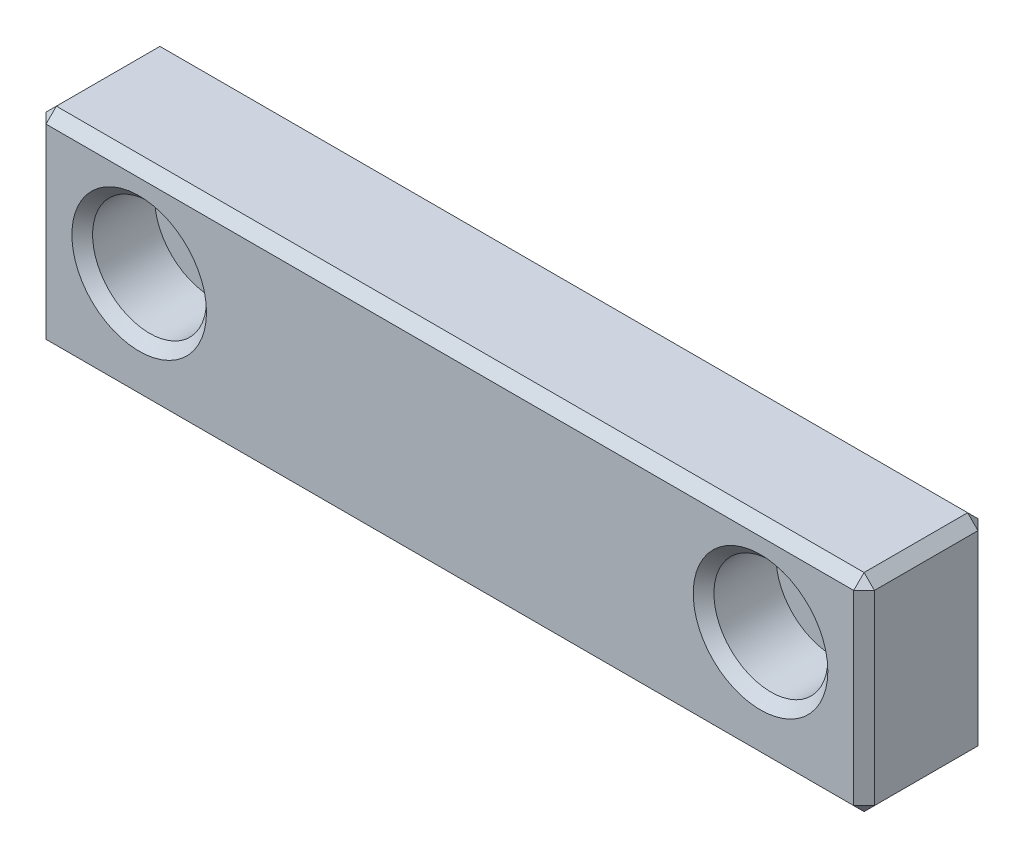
ISO-10303-21;
HEADER;
FILE_DESCRIPTION(('STEP AP214'),'2;1');
FILE_NAME('part.step','',(''),(''),'','','');
FILE_SCHEMA(('AUTOMOTIVE_DESIGN { 1 0 10303 214 1 1 1 1 }'));
ENDSEC;
DATA;
#1=APPLICATION_CONTEXT('core data for automotive mechanical design processes');
#2=APPLICATION_PROTOCOL_DEFINITION('international standard','automotive_design',2000,#1);
#3=PRODUCT_CONTEXT('',#1,'mechanical');
#4=PRODUCT('Part','Part','',(#3));
#5=PRODUCT_RELATED_PRODUCT_CATEGORY('part','',(#4));
#6=PRODUCT_DEFINITION_FORMATION('','',#4);
#7=PRODUCT_DEFINITION_CONTEXT('part definition',#1,'design');
#8=PRODUCT_DEFINITION('design','',#6,#7);
#9=PRODUCT_DEFINITION_SHAPE('','',#8);
#10=(LENGTH_UNIT() NAMED_UNIT(*) SI_UNIT(.MILLI.,.METRE.));
#11=(NAMED_UNIT(*) PLANE_ANGLE_UNIT() SI_UNIT($,.RADIAN.));
#12=(NAMED_UNIT(*) SI_UNIT($,.STERADIAN.) SOLID_ANGLE_UNIT());
#13=UNCERTAINTY_MEASURE_WITH_UNIT(LENGTH_MEASURE(1.E-05),#10,'distance_accuracy_value','');
#14=(GEOMETRIC_REPRESENTATION_CONTEXT(3) GLOBAL_UNCERTAINTY_ASSIGNED_CONTEXT((#13)) GLOBAL_UNIT_ASSIGNED_CONTEXT((#10,
#11,#12)) REPRESENTATION_CONTEXT('',''));
#15=CARTESIAN_POINT('',(0.,0.,0.));
#16=DIRECTION('',(0.,0.,1.));
#17=DIRECTION('',(1.,0.,0.));
#18=AXIS2_PLACEMENT_3D('',#15,#16,#17);
#19=CARTESIAN_POINT('',(-30.,1.,12.));
#20=DIRECTION('',(0.,0.,-1.));
#21=DIRECTION('',(-1.,0.,0.));
#22=AXIS2_PLACEMENT_3D('',#19,#20,#21);
#23=CYLINDRICAL_SURFACE('',#22,3.);
#24=CARTESIAN_POINT('',(-30.,1.,1.00000000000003));
#25=DIRECTION('',(0.,0.,1.));
#26=DIRECTION('',(1.,0.,0.));
#27=AXIS2_PLACEMENT_3D('',#24,#25,#26);
#28=CIRCLE('',#27,3.);
#29=CARTESIAN_POINT('',(-27.,1.,1.00000000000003));
#30=VERTEX_POINT('',#29);
#31=EDGE_CURVE('E156',#30,#30,#28,.F.);
#32=ORIENTED_EDGE('',*,*,#31,.T.);
#33=EDGE_LOOP('',(#32));
#34=FACE_BOUND('',#33,.T.);
#35=CARTESIAN_POINT('',(-30.,1.,5.));
#36=DIRECTION('',(0.,0.,1.));
#37=DIRECTION('',(1.,0.,0.));
#38=AXIS2_PLACEMENT_3D('',#35,#36,#37);
#39=CIRCLE('',#38,3.);
#40=CARTESIAN_POINT('',(-27.,1.,5.));
#41=VERTEX_POINT('',#40);
#42=EDGE_CURVE('E137',#41,#41,#39,.T.);
#43=ORIENTED_EDGE('',*,*,#42,.T.);
#44=EDGE_LOOP('',(#43));
#45=FACE_BOUND('',#44,.T.);
#46=ADVANCED_FACE('F16',(#34,#45),#23,.F.);
#47=CARTESIAN_POINT('',(30.,1.,12.));
#48=DIRECTION('',(0.,0.,-1.));
#49=DIRECTION('',(-1.,0.,0.));
#50=AXIS2_PLACEMENT_3D('',#47,#48,#49);
#51=CYLINDRICAL_SURFACE('',#50,3.);
#52=CARTESIAN_POINT('',(30.,1.,1.));
#53=DIRECTION('',(0.,0.,1.));
#54=DIRECTION('',(1.,0.,0.));
#55=AXIS2_PLACEMENT_3D('',#52,#53,#54);
#56=CIRCLE('',#55,3.);
#57=CARTESIAN_POINT('',(33.,1.,1.));
#58=VERTEX_POINT('',#57);
#59=EDGE_CURVE('E153',#58,#58,#56,.F.);
#60=ORIENTED_EDGE('',*,*,#59,.T.);
#61=EDGE_LOOP('',(#60));
#62=FACE_BOUND('',#61,.T.);
#63=CARTESIAN_POINT('',(30.,1.,5.));
#64=DIRECTION('',(0.,0.,1.));
#65=DIRECTION('',(1.,0.,0.));
#66=AXIS2_PLACEMENT_3D('',#63,#64,#65);
#67=CIRCLE('',#66,3.);
#68=CARTESIAN_POINT('',(33.,1.,5.));
#69=VERTEX_POINT('',#68);
#70=EDGE_CURVE('E274',#69,#69,#67,.T.);
#71=ORIENTED_EDGE('',*,*,#70,.T.);
#72=EDGE_LOOP('',(#71));
#73=FACE_BOUND('',#72,.T.);
#74=ADVANCED_FACE('F304',(#62,#73),#51,.F.);
#75=CARTESIAN_POINT('',(0.,0.,12.));
#76=DIRECTION('',(0.,0.,1.));
#77=DIRECTION('',(1.,0.,0.));
#78=AXIS2_PLACEMENT_3D('',#75,#76,#77);
#79=PLANE('',#78);
#80=DIRECTION('',(0.,1.,0.));
#81=VECTOR('',#80,1.);
#82=CARTESIAN_POINT('',(39.,10.,12.));
#83=LINE('',#82,#81);
#84=CARTESIAN_POINT('',(39.,-9.,12.));
#85=VERTEX_POINT('',#84);
#86=CARTESIAN_POINT('',(39.,9.,12.));
#87=VERTEX_POINT('',#86);
#88=EDGE_CURVE('E33',#85,#87,#83,.T.);
#89=ORIENTED_EDGE('',*,*,#88,.T.);
#90=DIRECTION('',(-1.,0.,0.));
#91=VECTOR('',#90,1.);
#92=CARTESIAN_POINT('',(-40.,9.,12.));
#93=LINE('',#92,#91);
#94=CARTESIAN_POINT('',(-39.,9.,12.));
#95=VERTEX_POINT('',#94);
#96=EDGE_CURVE('E203',#87,#95,#93,.T.);
#97=ORIENTED_EDGE('',*,*,#96,.T.);
#98=DIRECTION('',(0.,-1.,0.));
#99=VECTOR('',#98,1.);
#100=CARTESIAN_POINT('',(-39.,-10.,12.));
#101=LINE('',#100,#99);
#102=CARTESIAN_POINT('',(-39.,-9.,12.));
#103=VERTEX_POINT('',#102);
#104=EDGE_CURVE('E199',#95,#103,#101,.T.);
#105=ORIENTED_EDGE('',*,*,#104,.T.);
#106=DIRECTION('',(1.,0.,0.));
#107=VECTOR('',#106,1.);
#108=CARTESIAN_POINT('',(40.,-9.,12.));
#109=LINE('',#108,#107);
#110=EDGE_CURVE('E38',#103,#85,#109,.T.);
#111=ORIENTED_EDGE('',*,*,#110,.T.);
#112=EDGE_LOOP('',(#89,#97,#105,#111));
#113=FACE_BOUND('',#112,.T.);
#114=CARTESIAN_POINT('',(30.,1.,12.));
#115=DIRECTION('',(0.,0.,1.));
#116=DIRECTION('',(1.,0.,0.));
#117=AXIS2_PLACEMENT_3D('',#114,#115,#116);
#118=CIRCLE('',#117,6.5);
#119=CARTESIAN_POINT('',(36.5,1.,12.));
#120=VERTEX_POINT('',#119);
#121=EDGE_CURVE('E196',#120,#120,#118,.F.);
#122=ORIENTED_EDGE('',*,*,#121,.T.);
#123=EDGE_LOOP('',(#122));
#124=FACE_BOUND('',#123,.T.);
#125=CARTESIAN_POINT('',(-30.,1.,12.));
#126=DIRECTION('',(0.,0.,1.));
#127=DIRECTION('',(1.,0.,0.));
#128=AXIS2_PLACEMENT_3D('',#125,#126,#127);
#129=CIRCLE('',#128,6.5);
#130=CARTESIAN_POINT('',(-23.5,1.,12.));
#131=VERTEX_POINT('',#130);
#132=EDGE_CURVE('E193',#131,#131,#129,.F.);
#133=ORIENTED_EDGE('',*,*,#132,.T.);
#134=EDGE_LOOP('',(#133));
#135=FACE_BOUND('',#134,.T.);
#136=ADVANCED_FACE('F311',(#113,#124,#135),#79,.T.);
#137=CARTESIAN_POINT('',(0.,0.,0.));
#138=DIRECTION('',(0.,0.,1.));
#139=DIRECTION('',(1.,0.,0.));
#140=AXIS2_PLACEMENT_3D('',#137,#138,#139);
#141=PLANE('',#140);
#142=CARTESIAN_POINT('',(30.,1.,0.));
#143=DIRECTION('',(0.,0.,1.));
#144=DIRECTION('',(1.,0.,0.));
#145=AXIS2_PLACEMENT_3D('',#142,#143,#144);
#146=CIRCLE('',#145,4.);
#147=CARTESIAN_POINT('',(34.,1.,0.));
#148=VERTEX_POINT('',#147);
#149=EDGE_CURVE('E150',#148,#148,#146,.T.);
#150=ORIENTED_EDGE('',*,*,#149,.T.);
#151=EDGE_LOOP('',(#150));
#152=FACE_BOUND('',#151,.T.);
#153=CARTESIAN_POINT('',(-30.,1.,0.));
#154=DIRECTION('',(0.,0.,1.));
#155=DIRECTION('',(1.,0.,0.));
#156=AXIS2_PLACEMENT_3D('',#153,#154,#155);
#157=CIRCLE('',#156,4.);
#158=CARTESIAN_POINT('',(-26.,1.,0.));
#159=VERTEX_POINT('',#158);
#160=EDGE_CURVE('E144',#159,#159,#157,.T.);
#161=ORIENTED_EDGE('',*,*,#160,.T.);
#162=EDGE_LOOP('',(#161));
#163=FACE_BOUND('',#162,.T.);
#164=DIRECTION('',(0.,1.,0.));
#165=VECTOR('',#164,1.);
#166=CARTESIAN_POINT('',(-39.,0.,0.));
#167=LINE('',#166,#165);
#168=CARTESIAN_POINT('',(-39.,-9.,0.));
#169=VERTEX_POINT('',#168);
#170=CARTESIAN_POINT('',(-39.,9.,0.));
#171=VERTEX_POINT('',#170);
#172=EDGE_CURVE('E136',#169,#171,#167,.T.);
#173=ORIENTED_EDGE('',*,*,#172,.T.);
#174=DIRECTION('',(1.,0.,0.));
#175=VECTOR('',#174,1.);
#176=CARTESIAN_POINT('',(0.,9.,0.));
#177=LINE('',#176,#175);
#178=CARTESIAN_POINT('',(39.,9.,0.));
#179=VERTEX_POINT('',#178);
#180=EDGE_CURVE('E141',#171,#179,#177,.T.);
#181=ORIENTED_EDGE('',*,*,#180,.T.);
#182=DIRECTION('',(0.,-1.,0.));
#183=VECTOR('',#182,1.);
#184=CARTESIAN_POINT('',(39.,0.,0.));
#185=LINE('',#184,#183);
#186=CARTESIAN_POINT('',(39.,-9.,0.));
#187=VERTEX_POINT('',#186);
#188=EDGE_CURVE('E111',#179,#187,#185,.T.);
#189=ORIENTED_EDGE('',*,*,#188,.T.);
#190=DIRECTION('',(-1.,0.,0.));
#191=VECTOR('',#190,1.);
#192=CARTESIAN_POINT('',(0.,-9.,0.));
#193=LINE('',#192,#191);
#194=EDGE_CURVE('E130',#187,#169,#193,.T.);
#195=ORIENTED_EDGE('',*,*,#194,.T.);
#196=EDGE_LOOP('',(#173,#181,#189,#195));
#197=FACE_BOUND('',#196,.T.);
#198=ADVANCED_FACE('F139',(#152,#163,#197),#141,.F.);
#199=CARTESIAN_POINT('',(-40.,-10.,12.));
#200=DIRECTION('',(1.,0.,0.));
#201=DIRECTION('',(0.,0.,-1.));
#202=AXIS2_PLACEMENT_3D('',#199,#200,#201);
#203=PLANE('',#202);
#204=DIRECTION('',(0.,0.,-1.));
#205=VECTOR('',#204,1.);
#206=CARTESIAN_POINT('',(-40.,9.,12.));
#207=LINE('',#206,#205);
#208=CARTESIAN_POINT('',(-40.,9.,11.));
#209=VERTEX_POINT('',#208);
#210=CARTESIAN_POINT('',(-40.,9.,1.00000000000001));
#211=VERTEX_POINT('',#210);
#212=EDGE_CURVE('E170',#209,#211,#207,.T.);
#213=ORIENTED_EDGE('',*,*,#212,.T.);
#214=DIRECTION('',(0.,-1.,0.));
#215=VECTOR('',#214,1.);
#216=CARTESIAN_POINT('',(-40.,-10.,1.00000000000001));
#217=LINE('',#216,#215);
#218=CARTESIAN_POINT('',(-40.,-9.,1.00000000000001));
#219=VERTEX_POINT('',#218);
#220=EDGE_CURVE('E172',#211,#219,#217,.T.);
#221=ORIENTED_EDGE('',*,*,#220,.T.);
#222=DIRECTION('',(0.,0.,1.));
#223=VECTOR('',#222,1.);
#224=CARTESIAN_POINT('',(-40.,-9.,12.));
#225=LINE('',#224,#223);
#226=CARTESIAN_POINT('',(-40.,-9.,11.));
#227=VERTEX_POINT('',#226);
#228=EDGE_CURVE('E168',#219,#227,#225,.T.);
#229=ORIENTED_EDGE('',*,*,#228,.T.);
#230=DIRECTION('',(0.,1.,0.));
#231=VECTOR('',#230,1.);
#232=CARTESIAN_POINT('',(-40.,10.,11.));
#233=LINE('',#232,#231);
#234=EDGE_CURVE('E166',#227,#209,#233,.T.);
#235=ORIENTED_EDGE('',*,*,#234,.T.);
#236=EDGE_LOOP('',(#213,#221,#229,#235));
#237=FACE_BOUND('',#236,.T.);
#238=ADVANCED_FACE('F320',(#237),#203,.F.);
#239=CARTESIAN_POINT('',(40.,-10.,12.));
#240=DIRECTION('',(0.,1.,0.));
#241=DIRECTION('',(-1.,0.,0.));
#242=AXIS2_PLACEMENT_3D('',#239,#240,#241);
#243=PLANE('',#242);
#244=DIRECTION('',(-1.,0.,0.));
#245=VECTOR('',#244,1.);
#246=CARTESIAN_POINT('',(-40.,-10.,11.));
#247=LINE('',#246,#245);
#248=CARTESIAN_POINT('',(39.,-10.,11.));
#249=VERTEX_POINT('',#248);
#250=CARTESIAN_POINT('',(-39.,-10.,11.));
#251=VERTEX_POINT('',#250);
#252=EDGE_CURVE('E184',#249,#251,#247,.T.);
#253=ORIENTED_EDGE('',*,*,#252,.T.);
#254=DIRECTION('',(0.,0.,-1.));
#255=VECTOR('',#254,1.);
#256=CARTESIAN_POINT('',(-39.,-10.,12.));
#257=LINE('',#256,#255);
#258=CARTESIAN_POINT('',(-39.,-10.,1.));
#259=VERTEX_POINT('',#258);
#260=EDGE_CURVE('E190',#251,#259,#257,.T.);
#261=ORIENTED_EDGE('',*,*,#260,.T.);
#262=DIRECTION('',(1.,0.,0.));
#263=VECTOR('',#262,1.);
#264=CARTESIAN_POINT('',(40.,-10.,1.));
#265=LINE('',#264,#263);
#266=CARTESIAN_POINT('',(39.,-10.,1.));
#267=VERTEX_POINT('',#266);
#268=EDGE_CURVE('E188',#259,#267,#265,.T.);
#269=ORIENTED_EDGE('',*,*,#268,.T.);
#270=DIRECTION('',(0.,0.,1.));
#271=VECTOR('',#270,1.);
#272=CARTESIAN_POINT('',(39.,-10.,12.));
#273=LINE('',#272,#271);
#274=EDGE_CURVE('E186',#267,#249,#273,.T.);
#275=ORIENTED_EDGE('',*,*,#274,.T.);
#276=EDGE_LOOP('',(#253,#261,#269,#275));
#277=FACE_BOUND('',#276,.T.);
#278=ADVANCED_FACE('F329',(#277),#243,.F.);
#279=CARTESIAN_POINT('',(40.,-10.,12.));
#280=DIRECTION('',(-1.,0.,0.));
#281=DIRECTION('',(0.,0.,1.));
#282=AXIS2_PLACEMENT_3D('',#279,#280,#281);
#283=PLANE('',#282);
#284=DIRECTION('',(0.,0.,-1.));
#285=VECTOR('',#284,1.);
#286=CARTESIAN_POINT('',(40.,-9.,12.));
#287=LINE('',#286,#285);
#288=CARTESIAN_POINT('',(40.,-9.,11.));
#289=VERTEX_POINT('',#288);
#290=CARTESIAN_POINT('',(40.,-9.,1.));
#291=VERTEX_POINT('',#290);
#292=EDGE_CURVE('E161',#289,#291,#287,.T.);
#293=ORIENTED_EDGE('',*,*,#292,.T.);
#294=DIRECTION('',(0.,1.,0.));
#295=VECTOR('',#294,1.);
#296=CARTESIAN_POINT('',(40.,-10.,1.));
#297=LINE('',#296,#295);
#298=CARTESIAN_POINT('',(40.,9.,1.));
#299=VERTEX_POINT('',#298);
#300=EDGE_CURVE('E114',#291,#299,#297,.T.);
#301=ORIENTED_EDGE('',*,*,#300,.T.);
#302=DIRECTION('',(0.,0.,1.));
#303=VECTOR('',#302,1.);
#304=CARTESIAN_POINT('',(40.,9.,12.));
#305=LINE('',#304,#303);
#306=CARTESIAN_POINT('',(40.,9.,11.));
#307=VERTEX_POINT('',#306);
#308=EDGE_CURVE('E163',#299,#307,#305,.T.);
#309=ORIENTED_EDGE('',*,*,#308,.T.);
#310=DIRECTION('',(0.,-1.,0.));
#311=VECTOR('',#310,1.);
#312=CARTESIAN_POINT('',(40.,-10.,11.));
#313=LINE('',#312,#311);
#314=EDGE_CURVE('E159',#307,#289,#313,.T.);
#315=ORIENTED_EDGE('',*,*,#314,.T.);
#316=EDGE_LOOP('',(#293,#301,#309,#315));
#317=FACE_BOUND('',#316,.T.);
#318=ADVANCED_FACE('F325',(#317),#283,.F.);
#319=CARTESIAN_POINT('',(40.,10.,12.));
#320=DIRECTION('',(0.,-1.,0.));
#321=DIRECTION('',(1.,0.,0.));
#322=AXIS2_PLACEMENT_3D('',#319,#320,#321);
#323=PLANE('',#322);
#324=DIRECTION('',(1.,0.,0.));
#325=VECTOR('',#324,1.);
#326=CARTESIAN_POINT('',(40.,10.,11.));
#327=LINE('',#326,#325);
#328=CARTESIAN_POINT('',(-39.,10.,11.));
#329=VERTEX_POINT('',#328);
#330=CARTESIAN_POINT('',(39.,10.,11.));
#331=VERTEX_POINT('',#330);
#332=EDGE_CURVE('E175',#329,#331,#327,.T.);
#333=ORIENTED_EDGE('',*,*,#332,.T.);
#334=DIRECTION('',(0.,0.,-1.));
#335=VECTOR('',#334,1.);
#336=CARTESIAN_POINT('',(39.,10.,12.));
#337=LINE('',#336,#335);
#338=CARTESIAN_POINT('',(39.,10.,1.));
#339=VERTEX_POINT('',#338);
#340=EDGE_CURVE('E181',#331,#339,#337,.T.);
#341=ORIENTED_EDGE('',*,*,#340,.T.);
#342=DIRECTION('',(-1.,0.,0.));
#343=VECTOR('',#342,1.);
#344=CARTESIAN_POINT('',(40.,10.,1.));
#345=LINE('',#344,#343);
#346=CARTESIAN_POINT('',(-39.,10.,1.));
#347=VERTEX_POINT('',#346);
#348=EDGE_CURVE('E179',#339,#347,#345,.T.);
#349=ORIENTED_EDGE('',*,*,#348,.T.);
#350=DIRECTION('',(0.,0.,1.));
#351=VECTOR('',#350,1.);
#352=CARTESIAN_POINT('',(-39.,10.,12.));
#353=LINE('',#352,#351);
#354=EDGE_CURVE('E177',#347,#329,#353,.T.);
#355=ORIENTED_EDGE('',*,*,#354,.T.);
#356=EDGE_LOOP('',(#333,#341,#349,#355));
#357=FACE_BOUND('',#356,.T.);
#358=ADVANCED_FACE('F322',(#357),#323,.F.);
#359=CARTESIAN_POINT('',(30.,1.,5.));
#360=DIRECTION('',(0.,0.,1.));
#361=DIRECTION('',(1.,0.,0.));
#362=AXIS2_PLACEMENT_3D('',#359,#360,#361);
#363=CYLINDRICAL_SURFACE('',#362,5.5);
#364=CARTESIAN_POINT('',(30.,1.,11.));
#365=DIRECTION('',(0.,0.,1.));
#366=DIRECTION('',(1.,0.,0.));
#367=AXIS2_PLACEMENT_3D('',#364,#365,#366);
#368=CIRCLE('',#367,5.5);
#369=CARTESIAN_POINT('',(35.5,1.,11.));
#370=VERTEX_POINT('',#369);
#371=EDGE_CURVE('E25',#370,#370,#368,.T.);
#372=ORIENTED_EDGE('',*,*,#371,.T.);
#373=EDGE_LOOP('',(#372));
#374=FACE_BOUND('',#373,.T.);
#375=CARTESIAN_POINT('',(30.,1.,5.));
#376=DIRECTION('',(0.,0.,1.));
#377=DIRECTION('',(1.,0.,0.));
#378=AXIS2_PLACEMENT_3D('',#375,#376,#377);
#379=CIRCLE('',#378,5.5);
#380=CARTESIAN_POINT('',(35.5,1.,5.));
#381=VERTEX_POINT('',#380);
#382=EDGE_CURVE('E263',#381,#381,#379,.T.);
#383=ORIENTED_EDGE('',*,*,#382,.F.);
#384=EDGE_LOOP('',(#383));
#385=FACE_BOUND('',#384,.T.);
#386=ADVANCED_FACE('F300',(#374,#385),#363,.F.);
#387=CARTESIAN_POINT('',(30.,1.,5.));
#388=DIRECTION('',(0.,0.,1.));
#389=DIRECTION('',(1.,0.,0.));
#390=AXIS2_PLACEMENT_3D('',#387,#388,#389);
#391=PLANE('',#390);
#392=ORIENTED_EDGE('',*,*,#70,.F.);
#393=EDGE_LOOP('',(#392));
#394=FACE_BOUND('',#393,.T.);
#395=ORIENTED_EDGE('',*,*,#382,.T.);
#396=EDGE_LOOP('',(#395));
#397=FACE_BOUND('',#396,.T.);
#398=ADVANCED_FACE('F292',(#394,#397),#391,.T.);
#399=CARTESIAN_POINT('',(-30.,1.,5.));
#400=DIRECTION('',(0.,0.,1.));
#401=DIRECTION('',(1.,0.,0.));
#402=AXIS2_PLACEMENT_3D('',#399,#400,#401);
#403=CYLINDRICAL_SURFACE('',#402,5.5);
#404=CARTESIAN_POINT('',(-30.,1.,11.));
#405=DIRECTION('',(0.,0.,1.));
#406=DIRECTION('',(1.,0.,0.));
#407=AXIS2_PLACEMENT_3D('',#404,#405,#406);
#408=CIRCLE('',#407,5.5);
#409=CARTESIAN_POINT('',(-24.5,1.,11.));
#410=VERTEX_POINT('',#409);
#411=EDGE_CURVE('E10',#410,#410,#408,.T.);
#412=ORIENTED_EDGE('',*,*,#411,.T.);
#413=EDGE_LOOP('',(#412));
#414=FACE_BOUND('',#413,.T.);
#415=CARTESIAN_POINT('',(-30.,1.,5.));
#416=DIRECTION('',(0.,0.,1.));
#417=DIRECTION('',(1.,0.,0.));
#418=AXIS2_PLACEMENT_3D('',#415,#416,#417);
#419=CIRCLE('',#418,5.5);
#420=CARTESIAN_POINT('',(-24.5,1.,5.));
#421=VERTEX_POINT('',#420);
#422=EDGE_CURVE('E269',#421,#421,#419,.T.);
#423=ORIENTED_EDGE('',*,*,#422,.F.);
#424=EDGE_LOOP('',(#423));
#425=FACE_BOUND('',#424,.T.);
#426=ADVANCED_FACE('F287',(#414,#425),#403,.F.);
#427=CARTESIAN_POINT('',(-30.,1.,5.));
#428=DIRECTION('',(0.,0.,1.));
#429=DIRECTION('',(1.,0.,0.));
#430=AXIS2_PLACEMENT_3D('',#427,#428,#429);
#431=PLANE('',#430);
#432=ORIENTED_EDGE('',*,*,#42,.F.);
#433=EDGE_LOOP('',(#432));
#434=FACE_BOUND('',#433,.T.);
#435=ORIENTED_EDGE('',*,*,#422,.T.);
#436=EDGE_LOOP('',(#435));
#437=FACE_BOUND('',#436,.T.);
#438=ADVANCED_FACE('F283',(#434,#437),#431,.T.);
#439=CARTESIAN_POINT('',(30.,1.,0.));
#440=DIRECTION('',(0.,0.,-1.));
#441=DIRECTION('',(-1.,0.,0.));
#442=AXIS2_PLACEMENT_3D('',#439,#440,#441);
#443=CONICAL_SURFACE('',#442,4.,0.785398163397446);
#444=ORIENTED_EDGE('',*,*,#59,.F.);
#445=EDGE_LOOP('',(#444));
#446=FACE_BOUND('',#445,.T.);
#447=ORIENTED_EDGE('',*,*,#149,.F.);
#448=EDGE_LOOP('',(#447));
#449=FACE_BOUND('',#448,.T.);
#450=ADVANCED_FACE('F286',(#446,#449),#443,.F.);
#451=CARTESIAN_POINT('',(-30.,1.,0.));
#452=DIRECTION('',(0.,0.,-1.));
#453=DIRECTION('',(-1.,0.,0.));
#454=AXIS2_PLACEMENT_3D('',#451,#452,#453);
#455=CONICAL_SURFACE('',#454,4.,0.785398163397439);
#456=ORIENTED_EDGE('',*,*,#31,.F.);
#457=EDGE_LOOP('',(#456));
#458=FACE_BOUND('',#457,.T.);
#459=ORIENTED_EDGE('',*,*,#160,.F.);
#460=EDGE_LOOP('',(#459));
#461=FACE_BOUND('',#460,.T.);
#462=ADVANCED_FACE('F339',(#458,#461),#455,.F.);
#463=CARTESIAN_POINT('',(-39.,0.,12.));
#464=DIRECTION('',(-0.707106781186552,0.,0.707106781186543));
#465=DIRECTION('',(0.,1.,0.));
#466=AXIS2_PLACEMENT_3D('',#463,#464,#465);
#467=PLANE('',#466);
#468=DIRECTION('',(-0.707106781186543,0.,-0.707106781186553));
#469=VECTOR('',#468,1.);
#470=CARTESIAN_POINT('',(-40.,-9.,11.));
#471=LINE('',#470,#469);
#472=EDGE_CURVE('E20',#103,#227,#471,.T.);
#473=ORIENTED_EDGE('',*,*,#472,.F.);
#474=ORIENTED_EDGE('',*,*,#104,.F.);
#475=DIRECTION('',(0.707106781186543,0.,0.707106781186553));
#476=VECTOR('',#475,1.);
#477=CARTESIAN_POINT('',(-39.5,9.,11.5));
#478=LINE('',#477,#476);
#479=EDGE_CURVE('E255',#209,#95,#478,.T.);
#480=ORIENTED_EDGE('',*,*,#479,.F.);
#481=ORIENTED_EDGE('',*,*,#234,.F.);
#482=EDGE_LOOP('',(#473,#474,#480,#481));
#483=FACE_BOUND('',#482,.T.);
#484=ADVANCED_FACE('F343',(#483),#467,.T.);
#485=CARTESIAN_POINT('',(-40.,-9.,11.));
#486=DIRECTION('',(-0.577350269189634,-0.577350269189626,0.577350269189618));
#487=DIRECTION('',(0.707106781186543,-0.707106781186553,0.));
#488=AXIS2_PLACEMENT_3D('',#485,#486,#487);
#489=PLANE('',#488);
#490=DIRECTION('',(0.,0.707106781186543,0.707106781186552));
#491=VECTOR('',#490,1.);
#492=CARTESIAN_POINT('',(-39.,-9.5,11.5));
#493=LINE('',#492,#491);
#494=EDGE_CURVE('E250',#103,#251,#493,.F.);
#495=ORIENTED_EDGE('',*,*,#494,.F.);
#496=ORIENTED_EDGE('',*,*,#472,.T.);
#497=DIRECTION('',(-0.707106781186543,0.707106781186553,0.));
#498=VECTOR('',#497,1.);
#499=CARTESIAN_POINT('',(-40.,-9.,11.));
#500=LINE('',#499,#498);
#501=EDGE_CURVE('E253',#251,#227,#500,.T.);
#502=ORIENTED_EDGE('',*,*,#501,.F.);
#503=EDGE_LOOP('',(#495,#496,#502));
#504=FACE_BOUND('',#503,.T.);
#505=ADVANCED_FACE('F411',(#504),#489,.T.);
#506=CARTESIAN_POINT('',(-39.,10.,11.));
#507=DIRECTION('',(-0.577350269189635,0.577350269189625,0.577350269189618));
#508=DIRECTION('',(-0.707106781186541,-0.707106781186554,0.));
#509=AXIS2_PLACEMENT_3D('',#506,#507,#508);
#510=PLANE('',#509);
#511=DIRECTION('',(0.707106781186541,0.707106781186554,0.));
#512=VECTOR('',#511,1.);
#513=CARTESIAN_POINT('',(-39.,10.,11.));
#514=LINE('',#513,#512);
#515=EDGE_CURVE('E245',#209,#329,#514,.T.);
#516=ORIENTED_EDGE('',*,*,#515,.F.);
#517=ORIENTED_EDGE('',*,*,#479,.T.);
#518=DIRECTION('',(0.,0.707106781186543,-0.707106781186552));
#519=VECTOR('',#518,1.);
#520=CARTESIAN_POINT('',(-39.,10.,11.));
#521=LINE('',#520,#519);
#522=EDGE_CURVE('E248',#329,#95,#521,.F.);
#523=ORIENTED_EDGE('',*,*,#522,.F.);
#524=EDGE_LOOP('',(#516,#517,#523));
#525=FACE_BOUND('',#524,.T.);
#526=ADVANCED_FACE('F407',(#525),#510,.T.);
#527=CARTESIAN_POINT('',(-39.,-10.,12.));
#528=DIRECTION('',(0.707106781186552,0.707106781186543,0.));
#529=DIRECTION('',(0.,0.,-1.));
#530=AXIS2_PLACEMENT_3D('',#527,#528,#529);
#531=PLANE('',#530);
#532=ORIENTED_EDGE('',*,*,#501,.T.);
#533=ORIENTED_EDGE('',*,*,#228,.F.);
#534=DIRECTION('',(0.707106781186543,-0.707106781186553,0.));
#535=VECTOR('',#534,1.);
#536=CARTESIAN_POINT('',(-40.,-9.,1.00000000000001));
#537=LINE('',#536,#535);
#538=EDGE_CURVE('E240',#259,#219,#537,.F.);
#539=ORIENTED_EDGE('',*,*,#538,.F.);
#540=ORIENTED_EDGE('',*,*,#260,.F.);
#541=EDGE_LOOP('',(#532,#533,#539,#540));
#542=FACE_BOUND('',#541,.T.);
#543=ADVANCED_FACE('F403',(#542),#531,.F.);
#544=CARTESIAN_POINT('',(0.,-9.,12.));
#545=DIRECTION('',(0.,-0.707106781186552,0.707106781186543));
#546=DIRECTION('',(-1.,0.,0.));
#547=AXIS2_PLACEMENT_3D('',#544,#545,#546);
#548=PLANE('',#547);
#549=ORIENTED_EDGE('',*,*,#494,.T.);
#550=ORIENTED_EDGE('',*,*,#252,.F.);
#551=DIRECTION('',(0.,-0.707106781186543,-0.707106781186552));
#552=VECTOR('',#551,1.);
#553=CARTESIAN_POINT('',(39.,-10.,11.));
#554=LINE('',#553,#552);
#555=EDGE_CURVE('E237',#85,#249,#554,.T.);
#556=ORIENTED_EDGE('',*,*,#555,.F.);
#557=ORIENTED_EDGE('',*,*,#110,.F.);
#558=EDGE_LOOP('',(#549,#550,#556,#557));
#559=FACE_BOUND('',#558,.T.);
#560=ADVANCED_FACE('F399',(#559),#548,.T.);
#561=CARTESIAN_POINT('',(39.,0.,12.));
#562=DIRECTION('',(0.707106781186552,0.,0.707106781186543));
#563=DIRECTION('',(0.,-1.,0.));
#564=AXIS2_PLACEMENT_3D('',#561,#562,#563);
#565=PLANE('',#564);
#566=DIRECTION('',(0.707106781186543,0.,-0.707106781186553));
#567=VECTOR('',#566,1.);
#568=CARTESIAN_POINT('',(40.,9.,11.));
#569=LINE('',#568,#567);
#570=EDGE_CURVE('E231',#87,#307,#569,.T.);
#571=ORIENTED_EDGE('',*,*,#570,.F.);
#572=ORIENTED_EDGE('',*,*,#88,.F.);
#573=DIRECTION('',(-0.707106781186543,0.,0.707106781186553));
#574=VECTOR('',#573,1.);
#575=CARTESIAN_POINT('',(39.5,-9.,11.5));
#576=LINE('',#575,#574);
#577=EDGE_CURVE('E234',#289,#85,#576,.T.);
#578=ORIENTED_EDGE('',*,*,#577,.F.);
#579=ORIENTED_EDGE('',*,*,#314,.F.);
#580=EDGE_LOOP('',(#571,#572,#578,#579));
#581=FACE_BOUND('',#580,.T.);
#582=ADVANCED_FACE('F395',(#581),#565,.T.);
#583=CARTESIAN_POINT('',(0.,9.,12.));
#584=DIRECTION('',(0.,0.707106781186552,0.707106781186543));
#585=DIRECTION('',(1.,0.,0.));
#586=AXIS2_PLACEMENT_3D('',#583,#584,#585);
#587=PLANE('',#586);
#588=ORIENTED_EDGE('',*,*,#522,.T.);
#589=ORIENTED_EDGE('',*,*,#96,.F.);
#590=DIRECTION('',(0.,-0.707106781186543,0.707106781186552));
#591=VECTOR('',#590,1.);
#592=CARTESIAN_POINT('',(39.,9.5,11.5));
#593=LINE('',#592,#591);
#594=EDGE_CURVE('E228',#331,#87,#593,.T.);
#595=ORIENTED_EDGE('',*,*,#594,.F.);
#596=ORIENTED_EDGE('',*,*,#332,.F.);
#597=EDGE_LOOP('',(#588,#589,#595,#596));
#598=FACE_BOUND('',#597,.T.);
#599=ADVANCED_FACE('F391',(#598),#587,.T.);
#600=CARTESIAN_POINT('',(-40.,9.,12.));
#601=DIRECTION('',(0.707106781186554,-0.707106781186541,0.));
#602=DIRECTION('',(0.,0.,-1.));
#603=AXIS2_PLACEMENT_3D('',#600,#601,#602);
#604=PLANE('',#603);
#605=ORIENTED_EDGE('',*,*,#515,.T.);
#606=ORIENTED_EDGE('',*,*,#354,.F.);
#607=DIRECTION('',(-0.707106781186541,-0.707106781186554,0.));
#608=VECTOR('',#607,1.);
#609=CARTESIAN_POINT('',(-39.5,9.5,1.));
#610=LINE('',#609,#608);
#611=EDGE_CURVE('E225',#211,#347,#610,.F.);
#612=ORIENTED_EDGE('',*,*,#611,.F.);
#613=ORIENTED_EDGE('',*,*,#212,.F.);
#614=EDGE_LOOP('',(#605,#606,#612,#613));
#615=FACE_BOUND('',#614,.T.);
#616=ADVANCED_FACE('F387',(#615),#604,.F.);
#617=CARTESIAN_POINT('',(-40.,-10.,1.00000000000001));
#618=DIRECTION('',(0.707106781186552,0.,0.707106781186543));
#619=DIRECTION('',(0.,-1.,0.));
#620=AXIS2_PLACEMENT_3D('',#617,#618,#619);
#621=PLANE('',#620);
#622=DIRECTION('',(-0.707106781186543,0.,0.707106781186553));
#623=VECTOR('',#622,1.);
#624=CARTESIAN_POINT('',(-40.,-9.,1.00000000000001));
#625=LINE('',#624,#623);
#626=EDGE_CURVE('E242',#219,#169,#625,.F.);
#627=ORIENTED_EDGE('',*,*,#626,.F.);
#628=ORIENTED_EDGE('',*,*,#220,.F.);
#629=DIRECTION('',(0.707106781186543,0.,-0.707106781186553));
#630=VECTOR('',#629,1.);
#631=CARTESIAN_POINT('',(-39.,9.,0.));
#632=LINE('',#631,#630);
#633=EDGE_CURVE('E222',#171,#211,#632,.F.);
#634=ORIENTED_EDGE('',*,*,#633,.F.);
#635=ORIENTED_EDGE('',*,*,#172,.F.);
#636=EDGE_LOOP('',(#627,#628,#634,#635));
#637=FACE_BOUND('',#636,.T.);
#638=ADVANCED_FACE('F383',(#637),#621,.F.);
#639=CARTESIAN_POINT('',(-40.,-9.,1.00000000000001));
#640=DIRECTION('',(-0.577350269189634,-0.577350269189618,-0.577350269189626));
#641=DIRECTION('',(-0.707106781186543,0.,0.707106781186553));
#642=AXIS2_PLACEMENT_3D('',#639,#640,#641);
#643=PLANE('',#642);
#644=ORIENTED_EDGE('',*,*,#538,.T.);
#645=ORIENTED_EDGE('',*,*,#626,.T.);
#646=DIRECTION('',(0.,0.707106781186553,-0.707106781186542));
#647=VECTOR('',#646,1.);
#648=CARTESIAN_POINT('',(-39.,-9.5,0.5));
#649=LINE('',#648,#647);
#650=EDGE_CURVE('E133',#259,#169,#649,.T.);
#651=ORIENTED_EDGE('',*,*,#650,.F.);
#652=EDGE_LOOP('',(#644,#645,#651));
#653=FACE_BOUND('',#652,.T.);
#654=ADVANCED_FACE('F379',(#653),#643,.T.);
#655=CARTESIAN_POINT('',(39.,-10.,11.));
#656=DIRECTION('',(0.577350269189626,-0.577350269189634,0.577350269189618));
#657=DIRECTION('',(0.707106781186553,0.707106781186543,0.));
#658=AXIS2_PLACEMENT_3D('',#655,#656,#657);
#659=PLANE('',#658);
#660=ORIENTED_EDGE('',*,*,#577,.T.);
#661=ORIENTED_EDGE('',*,*,#555,.T.);
#662=DIRECTION('',(-0.707106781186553,-0.707106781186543,0.));
#663=VECTOR('',#662,1.);
#664=CARTESIAN_POINT('',(39.,-10.,11.));
#665=LINE('',#664,#663);
#666=EDGE_CURVE('E218',#289,#249,#665,.T.);
#667=ORIENTED_EDGE('',*,*,#666,.F.);
#668=EDGE_LOOP('',(#660,#661,#667));
#669=FACE_BOUND('',#668,.T.);
#670=ADVANCED_FACE('F375',(#669),#659,.T.);
#671=CARTESIAN_POINT('',(40.,9.,11.));
#672=DIRECTION('',(0.577350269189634,0.577350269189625,0.577350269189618));
#673=DIRECTION('',(-0.707106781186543,0.707106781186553,0.));
#674=AXIS2_PLACEMENT_3D('',#671,#672,#673);
#675=PLANE('',#674);
#676=ORIENTED_EDGE('',*,*,#594,.T.);
#677=ORIENTED_EDGE('',*,*,#570,.T.);
#678=DIRECTION('',(0.707106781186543,-0.707106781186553,0.));
#679=VECTOR('',#678,1.);
#680=CARTESIAN_POINT('',(40.,9.,11.));
#681=LINE('',#680,#679);
#682=EDGE_CURVE('E215',#331,#307,#681,.T.);
#683=ORIENTED_EDGE('',*,*,#682,.F.);
#684=EDGE_LOOP('',(#676,#677,#683));
#685=FACE_BOUND('',#684,.T.);
#686=ADVANCED_FACE('F371',(#685),#675,.T.);
#687=CARTESIAN_POINT('',(-39.,9.,0.));
#688=DIRECTION('',(-0.577350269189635,0.577350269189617,-0.577350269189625));
#689=DIRECTION('',(-0.707106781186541,0.,0.707106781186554));
#690=AXIS2_PLACEMENT_3D('',#687,#688,#689);
#691=PLANE('',#690);
#692=ORIENTED_EDGE('',*,*,#633,.T.);
#693=ORIENTED_EDGE('',*,*,#611,.T.);
#694=DIRECTION('',(0.,0.707106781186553,0.707106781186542));
#695=VECTOR('',#694,1.);
#696=CARTESIAN_POINT('',(-39.,9.,0.));
#697=LINE('',#696,#695);
#698=EDGE_CURVE('E127',#171,#347,#697,.T.);
#699=ORIENTED_EDGE('',*,*,#698,.F.);
#700=EDGE_LOOP('',(#692,#693,#699));
#701=FACE_BOUND('',#700,.T.);
#702=ADVANCED_FACE('F368',(#701),#691,.T.);
#703=CARTESIAN_POINT('',(40.,-10.,1.));
#704=DIRECTION('',(0.,0.707106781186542,0.707106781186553));
#705=DIRECTION('',(1.,0.,0.));
#706=AXIS2_PLACEMENT_3D('',#703,#704,#705);
#707=PLANE('',#706);
#708=ORIENTED_EDGE('',*,*,#650,.T.);
#709=ORIENTED_EDGE('',*,*,#194,.F.);
#710=DIRECTION('',(0.,-0.707106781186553,0.707106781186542));
#711=VECTOR('',#710,1.);
#712=CARTESIAN_POINT('',(39.,-9.,0.));
#713=LINE('',#712,#711);
#714=EDGE_CURVE('E121',#267,#187,#713,.F.);
#715=ORIENTED_EDGE('',*,*,#714,.F.);
#716=ORIENTED_EDGE('',*,*,#268,.F.);
#717=EDGE_LOOP('',(#708,#709,#715,#716));
#718=FACE_BOUND('',#717,.T.);
#719=ADVANCED_FACE('F131',(#718),#707,.F.);
#720=CARTESIAN_POINT('',(40.,-9.,12.));
#721=DIRECTION('',(-0.707106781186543,0.707106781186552,0.));
#722=DIRECTION('',(0.,0.,-1.));
#723=AXIS2_PLACEMENT_3D('',#720,#721,#722);
#724=PLANE('',#723);
#725=ORIENTED_EDGE('',*,*,#666,.T.);
#726=ORIENTED_EDGE('',*,*,#274,.F.);
#727=DIRECTION('',(0.707106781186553,0.707106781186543,0.));
#728=VECTOR('',#727,1.);
#729=CARTESIAN_POINT('',(39.5,-9.5,1.));
#730=LINE('',#729,#728);
#731=EDGE_CURVE('E125',#291,#267,#730,.F.);
#732=ORIENTED_EDGE('',*,*,#731,.F.);
#733=ORIENTED_EDGE('',*,*,#292,.F.);
#734=EDGE_LOOP('',(#725,#726,#732,#733));
#735=FACE_BOUND('',#734,.T.);
#736=ADVANCED_FACE('F361',(#735),#724,.F.);
#737=CARTESIAN_POINT('',(39.,10.,12.));
#738=DIRECTION('',(-0.707106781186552,-0.707106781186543,0.));
#739=DIRECTION('',(0.,0.,-1.));
#740=AXIS2_PLACEMENT_3D('',#737,#738,#739);
#741=PLANE('',#740);
#742=ORIENTED_EDGE('',*,*,#682,.T.);
#743=ORIENTED_EDGE('',*,*,#308,.F.);
#744=DIRECTION('',(-0.707106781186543,0.707106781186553,0.));
#745=VECTOR('',#744,1.);
#746=CARTESIAN_POINT('',(40.,9.,1.));
#747=LINE('',#746,#745);
#748=EDGE_CURVE('E209',#339,#299,#747,.F.);
#749=ORIENTED_EDGE('',*,*,#748,.F.);
#750=ORIENTED_EDGE('',*,*,#340,.F.);
#751=EDGE_LOOP('',(#742,#743,#749,#750));
#752=FACE_BOUND('',#751,.T.);
#753=ADVANCED_FACE('F357',(#752),#741,.F.);
#754=CARTESIAN_POINT('',(40.,10.,1.));
#755=DIRECTION('',(0.,-0.707106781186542,0.707106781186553));
#756=DIRECTION('',(-1.,0.,0.));
#757=AXIS2_PLACEMENT_3D('',#754,#755,#756);
#758=PLANE('',#757);
#759=ORIENTED_EDGE('',*,*,#698,.T.);
#760=ORIENTED_EDGE('',*,*,#348,.F.);
#761=DIRECTION('',(0.,-0.707106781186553,-0.707106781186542));
#762=VECTOR('',#761,1.);
#763=CARTESIAN_POINT('',(39.,9.5,0.5));
#764=LINE('',#763,#762);
#765=EDGE_CURVE('E117',#179,#339,#764,.F.);
#766=ORIENTED_EDGE('',*,*,#765,.F.);
#767=ORIENTED_EDGE('',*,*,#180,.F.);
#768=EDGE_LOOP('',(#759,#760,#766,#767));
#769=FACE_BOUND('',#768,.T.);
#770=ADVANCED_FACE('F354',(#769),#758,.F.);
#771=CARTESIAN_POINT('',(39.,-9.,0.));
#772=DIRECTION('',(0.577350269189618,-0.577350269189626,-0.577350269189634));
#773=DIRECTION('',(0.,0.707106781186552,-0.707106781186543));
#774=AXIS2_PLACEMENT_3D('',#771,#772,#773);
#775=PLANE('',#774);
#776=ORIENTED_EDGE('',*,*,#731,.T.);
#777=ORIENTED_EDGE('',*,*,#714,.T.);
#778=DIRECTION('',(-0.707106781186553,0.,-0.707106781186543));
#779=VECTOR('',#778,1.);
#780=CARTESIAN_POINT('',(39.,-9.,0.));
#781=LINE('',#780,#779);
#782=EDGE_CURVE('E107',#291,#187,#781,.T.);
#783=ORIENTED_EDGE('',*,*,#782,.F.);
#784=EDGE_LOOP('',(#776,#777,#783));
#785=FACE_BOUND('',#784,.T.);
#786=ADVANCED_FACE('F123',(#785),#775,.T.);
#787=CARTESIAN_POINT('',(40.,9.,1.));
#788=DIRECTION('',(0.577350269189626,0.577350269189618,-0.577350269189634));
#789=DIRECTION('',(-0.707106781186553,0.,-0.707106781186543));
#790=AXIS2_PLACEMENT_3D('',#787,#788,#789);
#791=PLANE('',#790);
#792=ORIENTED_EDGE('',*,*,#765,.T.);
#793=ORIENTED_EDGE('',*,*,#748,.T.);
#794=DIRECTION('',(0.707106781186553,0.,0.707106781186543));
#795=VECTOR('',#794,1.);
#796=CARTESIAN_POINT('',(40.,9.,1.));
#797=LINE('',#796,#795);
#798=EDGE_CURVE('E118',#179,#299,#797,.T.);
#799=ORIENTED_EDGE('',*,*,#798,.F.);
#800=EDGE_LOOP('',(#792,#793,#799));
#801=FACE_BOUND('',#800,.T.);
#802=ADVANCED_FACE('F348',(#801),#791,.T.);
#803=CARTESIAN_POINT('',(40.,-10.,1.));
#804=DIRECTION('',(-0.707106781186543,0.,0.707106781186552));
#805=DIRECTION('',(0.,1.,0.));
#806=AXIS2_PLACEMENT_3D('',#803,#804,#805);
#807=PLANE('',#806);
#808=ORIENTED_EDGE('',*,*,#782,.T.);
#809=ORIENTED_EDGE('',*,*,#188,.F.);
#810=ORIENTED_EDGE('',*,*,#798,.T.);
#811=ORIENTED_EDGE('',*,*,#300,.F.);
#812=EDGE_LOOP('',(#808,#809,#810,#811));
#813=FACE_BOUND('',#812,.T.);
#814=ADVANCED_FACE('F109',(#813),#807,.F.);
#815=CARTESIAN_POINT('',(30.,1.,11.));
#816=DIRECTION('',(0.,0.,1.));
#817=DIRECTION('',(1.,0.,0.));
#818=AXIS2_PLACEMENT_3D('',#815,#816,#817);
#819=CONICAL_SURFACE('',#818,5.5,0.785398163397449);
#820=ORIENTED_EDGE('',*,*,#121,.F.);
#821=EDGE_LOOP('',(#820));
#822=FACE_BOUND('',#821,.T.);
#823=ORIENTED_EDGE('',*,*,#371,.F.);
#824=EDGE_LOOP('',(#823));
#825=FACE_BOUND('',#824,.T.);
#826=ADVANCED_FACE('F347',(#822,#825),#819,.F.);
#827=CARTESIAN_POINT('',(-30.,1.,11.));
#828=DIRECTION('',(0.,0.,1.));
#829=DIRECTION('',(1.,0.,0.));
#830=AXIS2_PLACEMENT_3D('',#827,#828,#829);
#831=CONICAL_SURFACE('',#830,5.5,0.785398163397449);
#832=ORIENTED_EDGE('',*,*,#132,.F.);
#833=EDGE_LOOP('',(#832));
#834=FACE_BOUND('',#833,.T.);
#835=ORIENTED_EDGE('',*,*,#411,.F.);
#836=EDGE_LOOP('',(#835));
#837=FACE_BOUND('',#836,.T.);
#838=ADVANCED_FACE('F18',(#834,#837),#831,.F.);
#839=CLOSED_SHELL('',(#46,#74,#136,#198,#238,#278,#318,#358,#386,#398,#426,#438,#450,#462,#484,
#505,#526,#543,#560,#582,#599,#616,#638,#654,#670,#686,#702,#719,#736,#753,#770,#786,#802,#814,
#826,#838));
#840=MANIFOLD_SOLID_BREP('B1',#839);
#841=ADVANCED_BREP_SHAPE_REPRESENTATION('',(#18,#840),#14);
#842=SHAPE_DEFINITION_REPRESENTATION(#9,#841);
ENDSEC;
END-ISO-10303-21;
